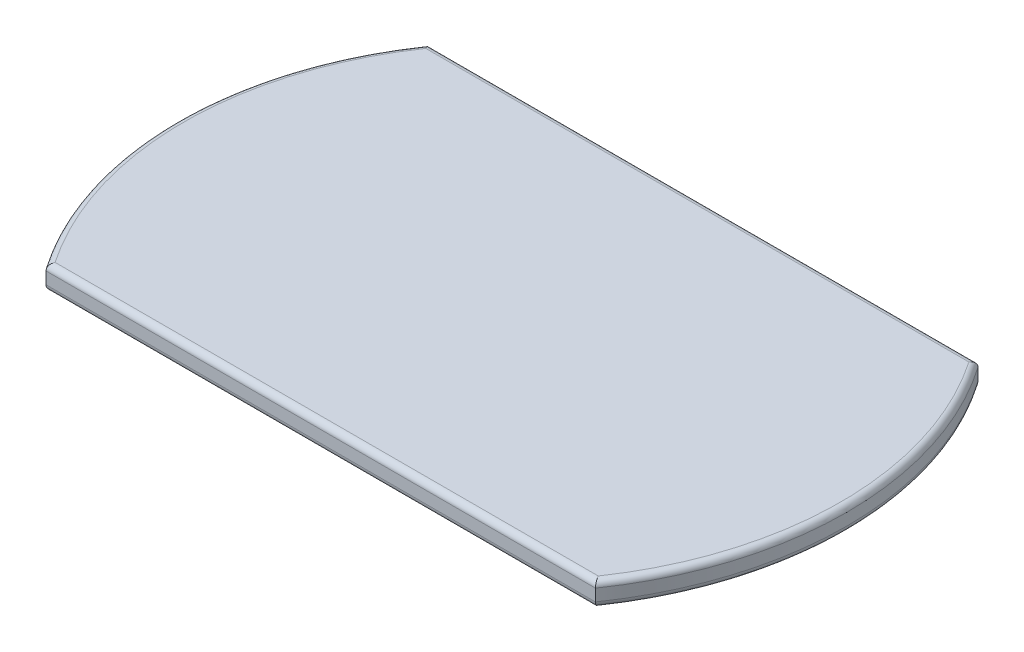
ISO-10303-21;
HEADER;
FILE_DESCRIPTION(('STEP AP214'),'2;1');
FILE_NAME('part.step','',(''),(''),'','','');
FILE_SCHEMA(('AUTOMOTIVE_DESIGN { 1 0 10303 214 1 1 1 1 }'));
ENDSEC;
DATA;
#1=APPLICATION_CONTEXT('core data for automotive mechanical design processes');
#2=APPLICATION_PROTOCOL_DEFINITION('international standard','automotive_design',2000,#1);
#3=PRODUCT_CONTEXT('',#1,'mechanical');
#4=PRODUCT('Part','Part','',(#3));
#5=PRODUCT_RELATED_PRODUCT_CATEGORY('part','',(#4));
#6=PRODUCT_DEFINITION_FORMATION('','',#4);
#7=PRODUCT_DEFINITION_CONTEXT('part definition',#1,'design');
#8=PRODUCT_DEFINITION('design','',#6,#7);
#9=PRODUCT_DEFINITION_SHAPE('','',#8);
#10=(LENGTH_UNIT() NAMED_UNIT(*) SI_UNIT(.MILLI.,.METRE.));
#11=(NAMED_UNIT(*) PLANE_ANGLE_UNIT() SI_UNIT($,.RADIAN.));
#12=(NAMED_UNIT(*) SI_UNIT($,.STERADIAN.) SOLID_ANGLE_UNIT());
#13=UNCERTAINTY_MEASURE_WITH_UNIT(LENGTH_MEASURE(1.E-05),#10,'distance_accuracy_value','');
#14=(GEOMETRIC_REPRESENTATION_CONTEXT(3) GLOBAL_UNCERTAINTY_ASSIGNED_CONTEXT((#13)) GLOBAL_UNIT_ASSIGNED_CONTEXT((#10,
#11,#12)) REPRESENTATION_CONTEXT('',''));
#15=CARTESIAN_POINT('',(0.,0.,0.));
#16=DIRECTION('',(0.,0.,1.));
#17=DIRECTION('',(1.,0.,0.));
#18=AXIS2_PLACEMENT_3D('',#15,#16,#17);
#19=CARTESIAN_POINT('',(0.,-12.7,0.));
#20=DIRECTION('',(0.,1.,0.));
#21=DIRECTION('',(0.,0.,1.));
#22=AXIS2_PLACEMENT_3D('',#19,#20,#21);
#23=CYLINDRICAL_SURFACE('',#22,177.8);
#24=DIRECTION('',(0.,1.,0.));
#25=VECTOR('',#24,1.);
#26=CARTESIAN_POINT('',(-145.911891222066,-12.7,-101.6));
#27=LINE('',#26,#25);
#28=CARTESIAN_POINT('',(-145.911891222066,-9.525,-101.6));
#29=VERTEX_POINT('',#28);
#30=CARTESIAN_POINT('',(-145.911891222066,-3.175,-101.6));
#31=VERTEX_POINT('',#30);
#32=EDGE_CURVE('E117',#29,#31,#27,.T.);
#33=ORIENTED_EDGE('',*,*,#32,.F.);
#34=CARTESIAN_POINT('',(0.,-9.525,0.));
#35=DIRECTION('',(0.,1.,0.));
#36=DIRECTION('',(0.,0.,1.));
#37=AXIS2_PLACEMENT_3D('',#34,#35,#36);
#38=CIRCLE('',#37,177.8);
#39=CARTESIAN_POINT('',(-145.911891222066,-9.525,101.6));
#40=VERTEX_POINT('',#39);
#41=EDGE_CURVE('E11',#29,#40,#38,.T.);
#42=ORIENTED_EDGE('',*,*,#41,.T.);
#43=DIRECTION('',(0.,1.,0.));
#44=VECTOR('',#43,1.);
#45=CARTESIAN_POINT('',(-145.911891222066,-12.7,101.6));
#46=LINE('',#45,#44);
#47=CARTESIAN_POINT('',(-145.911891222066,-3.175,101.6));
#48=VERTEX_POINT('',#47);
#49=EDGE_CURVE('E256',#40,#48,#46,.T.);
#50=ORIENTED_EDGE('',*,*,#49,.T.);
#51=CARTESIAN_POINT('',(0.,-3.175,0.));
#52=DIRECTION('',(0.,1.,0.));
#53=DIRECTION('',(0.,0.,1.));
#54=AXIS2_PLACEMENT_3D('',#51,#52,#53);
#55=CIRCLE('',#54,177.8);
#56=EDGE_CURVE('E134',#48,#31,#55,.F.);
#57=ORIENTED_EDGE('',*,*,#56,.T.);
#58=EDGE_LOOP('',(#33,#42,#50,#57));
#59=FACE_BOUND('',#58,.T.);
#60=ADVANCED_FACE('F32',(#59),#23,.T.);
#61=CARTESIAN_POINT('',(-145.911891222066,-12.7,-101.6));
#62=DIRECTION('',(0.,0.,-1.));
#63=DIRECTION('',(-1.,0.,0.));
#64=AXIS2_PLACEMENT_3D('',#61,#62,#63);
#65=PLANE('',#64);
#66=DIRECTION('',(0.,1.,0.));
#67=VECTOR('',#66,1.);
#68=CARTESIAN_POINT('',(145.911891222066,-12.7,-101.6));
#69=LINE('',#68,#67);
#70=CARTESIAN_POINT('',(145.911891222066,-9.525,-101.6));
#71=VERTEX_POINT('',#70);
#72=CARTESIAN_POINT('',(145.911891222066,-3.175,-101.6));
#73=VERTEX_POINT('',#72);
#74=EDGE_CURVE('E252',#71,#73,#69,.T.);
#75=ORIENTED_EDGE('',*,*,#74,.F.);
#76=DIRECTION('',(-1.,0.,0.));
#77=VECTOR('',#76,1.);
#78=CARTESIAN_POINT('',(-145.911891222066,-9.525,-101.6));
#79=LINE('',#78,#77);
#80=EDGE_CURVE('E39',#71,#29,#79,.T.);
#81=ORIENTED_EDGE('',*,*,#80,.T.);
#82=ORIENTED_EDGE('',*,*,#32,.T.);
#83=DIRECTION('',(-1.,0.,0.));
#84=VECTOR('',#83,1.);
#85=CARTESIAN_POINT('',(-145.911891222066,-3.175,-101.6));
#86=LINE('',#85,#84);
#87=EDGE_CURVE('E103',#31,#73,#86,.F.);
#88=ORIENTED_EDGE('',*,*,#87,.T.);
#89=EDGE_LOOP('',(#75,#81,#82,#88));
#90=FACE_BOUND('',#89,.T.);
#91=ADVANCED_FACE('F236',(#90),#65,.T.);
#92=CARTESIAN_POINT('',(0.,-12.7,0.));
#93=DIRECTION('',(0.,1.,0.));
#94=DIRECTION('',(0.,0.,1.));
#95=AXIS2_PLACEMENT_3D('',#92,#93,#94);
#96=CYLINDRICAL_SURFACE('',#95,177.8);
#97=DIRECTION('',(0.,1.,0.));
#98=VECTOR('',#97,1.);
#99=CARTESIAN_POINT('',(145.911891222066,-12.7,101.6));
#100=LINE('',#99,#98);
#101=CARTESIAN_POINT('',(145.911891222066,-9.525,101.6));
#102=VERTEX_POINT('',#101);
#103=CARTESIAN_POINT('',(145.911891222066,-3.175,101.6));
#104=VERTEX_POINT('',#103);
#105=EDGE_CURVE('E255',#102,#104,#100,.T.);
#106=ORIENTED_EDGE('',*,*,#105,.F.);
#107=CARTESIAN_POINT('',(0.,-9.525,0.));
#108=DIRECTION('',(0.,1.,0.));
#109=DIRECTION('',(0.,0.,1.));
#110=AXIS2_PLACEMENT_3D('',#107,#108,#109);
#111=CIRCLE('',#110,177.8);
#112=EDGE_CURVE('E53',#102,#71,#111,.T.);
#113=ORIENTED_EDGE('',*,*,#112,.T.);
#114=ORIENTED_EDGE('',*,*,#74,.T.);
#115=CARTESIAN_POINT('',(0.,-3.175,0.));
#116=DIRECTION('',(0.,1.,0.));
#117=DIRECTION('',(0.,0.,1.));
#118=AXIS2_PLACEMENT_3D('',#115,#116,#117);
#119=CIRCLE('',#118,177.8);
#120=EDGE_CURVE('E124',#73,#104,#119,.F.);
#121=ORIENTED_EDGE('',*,*,#120,.T.);
#122=EDGE_LOOP('',(#106,#113,#114,#121));
#123=FACE_BOUND('',#122,.T.);
#124=ADVANCED_FACE('F239',(#123),#96,.T.);
#125=CARTESIAN_POINT('',(-145.911891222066,-12.7,101.6));
#126=DIRECTION('',(0.,0.,1.));
#127=DIRECTION('',(1.,0.,0.));
#128=AXIS2_PLACEMENT_3D('',#125,#126,#127);
#129=PLANE('',#128);
#130=ORIENTED_EDGE('',*,*,#49,.F.);
#131=DIRECTION('',(1.,0.,0.));
#132=VECTOR('',#131,1.);
#133=CARTESIAN_POINT('',(145.911891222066,-9.525,101.6));
#134=LINE('',#133,#132);
#135=EDGE_CURVE('E137',#40,#102,#134,.T.);
#136=ORIENTED_EDGE('',*,*,#135,.T.);
#137=ORIENTED_EDGE('',*,*,#105,.T.);
#138=DIRECTION('',(1.,0.,0.));
#139=VECTOR('',#138,1.);
#140=CARTESIAN_POINT('',(-145.911891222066,-3.175,101.6));
#141=LINE('',#140,#139);
#142=EDGE_CURVE('E131',#104,#48,#141,.F.);
#143=ORIENTED_EDGE('',*,*,#142,.T.);
#144=EDGE_LOOP('',(#130,#136,#137,#143));
#145=FACE_BOUND('',#144,.T.);
#146=ADVANCED_FACE('F235',(#145),#129,.T.);
#147=CARTESIAN_POINT('',(0.,-12.7,0.));
#148=DIRECTION('',(0.,1.,0.));
#149=DIRECTION('',(0.,0.,1.));
#150=AXIS2_PLACEMENT_3D('',#147,#148,#149);
#151=PLANE('',#150);
#152=CARTESIAN_POINT('',(0.,-12.7,0.));
#153=DIRECTION('',(0.,1.,0.));
#154=DIRECTION('',(0.,0.,1.));
#155=AXIS2_PLACEMENT_3D('',#152,#153,#154);
#156=CIRCLE('',#155,174.625);
#157=CARTESIAN_POINT('',(144.244271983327,-12.7,-98.425));
#158=VERTEX_POINT('',#157);
#159=CARTESIAN_POINT('',(144.244271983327,-12.7,98.425));
#160=VERTEX_POINT('',#159);
#161=EDGE_CURVE('E144',#158,#160,#156,.F.);
#162=ORIENTED_EDGE('',*,*,#161,.T.);
#163=DIRECTION('',(1.,0.,0.));
#164=VECTOR('',#163,1.);
#165=CARTESIAN_POINT('',(-145.911891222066,-12.7,98.425));
#166=LINE('',#165,#164);
#167=CARTESIAN_POINT('',(-144.244271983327,-12.7,98.425));
#168=VERTEX_POINT('',#167);
#169=EDGE_CURVE('E146',#160,#168,#166,.F.);
#170=ORIENTED_EDGE('',*,*,#169,.T.);
#171=CARTESIAN_POINT('',(0.,-12.7,0.));
#172=DIRECTION('',(0.,1.,0.));
#173=DIRECTION('',(0.,0.,1.));
#174=AXIS2_PLACEMENT_3D('',#171,#172,#173);
#175=CIRCLE('',#174,174.625);
#176=CARTESIAN_POINT('',(-144.244271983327,-12.7,-98.425));
#177=VERTEX_POINT('',#176);
#178=EDGE_CURVE('E140',#168,#177,#175,.F.);
#179=ORIENTED_EDGE('',*,*,#178,.T.);
#180=DIRECTION('',(-1.,0.,0.));
#181=VECTOR('',#180,1.);
#182=CARTESIAN_POINT('',(145.911891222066,-12.7,-98.425));
#183=LINE('',#182,#181);
#184=EDGE_CURVE('E142',#177,#158,#183,.F.);
#185=ORIENTED_EDGE('',*,*,#184,.T.);
#186=EDGE_LOOP('',(#162,#170,#179,#185));
#187=FACE_BOUND('',#186,.T.);
#188=ADVANCED_FACE('F151',(#187),#151,.F.);
#189=CARTESIAN_POINT('',(0.,0.,0.));
#190=DIRECTION('',(0.,1.,0.));
#191=DIRECTION('',(0.,0.,1.));
#192=AXIS2_PLACEMENT_3D('',#189,#190,#191);
#193=PLANE('',#192);
#194=CARTESIAN_POINT('',(0.,0.,0.));
#195=DIRECTION('',(0.,1.,0.));
#196=DIRECTION('',(0.,0.,1.));
#197=AXIS2_PLACEMENT_3D('',#194,#195,#196);
#198=CIRCLE('',#197,174.625);
#199=CARTESIAN_POINT('',(144.244271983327,0.,98.425));
#200=VERTEX_POINT('',#199);
#201=CARTESIAN_POINT('',(144.244271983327,0.,-98.425));
#202=VERTEX_POINT('',#201);
#203=EDGE_CURVE('E121',#200,#202,#198,.T.);
#204=ORIENTED_EDGE('',*,*,#203,.T.);
#205=DIRECTION('',(-1.,0.,0.));
#206=VECTOR('',#205,1.);
#207=CARTESIAN_POINT('',(0.,0.,-98.425));
#208=LINE('',#207,#206);
#209=CARTESIAN_POINT('',(-144.244271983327,0.,-98.425));
#210=VERTEX_POINT('',#209);
#211=EDGE_CURVE('E101',#202,#210,#208,.T.);
#212=ORIENTED_EDGE('',*,*,#211,.T.);
#213=CARTESIAN_POINT('',(0.,0.,0.));
#214=DIRECTION('',(0.,1.,0.));
#215=DIRECTION('',(0.,0.,1.));
#216=AXIS2_PLACEMENT_3D('',#213,#214,#215);
#217=CIRCLE('',#216,174.625);
#218=CARTESIAN_POINT('',(-144.244271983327,0.,98.425));
#219=VERTEX_POINT('',#218);
#220=EDGE_CURVE('E110',#210,#219,#217,.T.);
#221=ORIENTED_EDGE('',*,*,#220,.T.);
#222=DIRECTION('',(1.,0.,0.));
#223=VECTOR('',#222,1.);
#224=CARTESIAN_POINT('',(0.,0.,98.425));
#225=LINE('',#224,#223);
#226=EDGE_CURVE('E116',#219,#200,#225,.T.);
#227=ORIENTED_EDGE('',*,*,#226,.T.);
#228=EDGE_LOOP('',(#204,#212,#221,#227));
#229=FACE_BOUND('',#228,.T.);
#230=ADVANCED_FACE('F119',(#229),#193,.T.);
#231=CARTESIAN_POINT('',(0.,-3.175,98.425));
#232=DIRECTION('',(1.,0.,0.));
#233=DIRECTION('',(0.,0.,-1.));
#234=AXIS2_PLACEMENT_3D('',#231,#232,#233);
#235=CYLINDRICAL_SURFACE('',#234,3.175);
#236=CARTESIAN_POINT('',(-145.911891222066,-3.175,101.6));
#237=CARTESIAN_POINT('',(-145.911897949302,-3.09298623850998,101.60001310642));
#238=CARTESIAN_POINT('',(-145.91023185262,-3.01097973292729,101.596822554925));
#239=CARTESIAN_POINT('',(-145.903605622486,-2.847612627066,101.584134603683));
#240=CARTESIAN_POINT('',(-145.898646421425,-2.76625185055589,101.574638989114));
#241=CARTESIAN_POINT('',(-145.88550979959,-2.60505816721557,101.549487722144));
#242=CARTESIAN_POINT('',(-145.877344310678,-2.52522073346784,101.533854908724));
#243=CARTESIAN_POINT('',(-145.857899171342,-2.36735467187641,101.496631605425));
#244=CARTESIAN_POINT('',(-145.846619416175,-2.28932610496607,101.475040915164));
#245=CARTESIAN_POINT('',(-145.808300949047,-2.05886594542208,101.40170581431));
#246=CARTESIAN_POINT('',(-145.7767618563,-1.90980503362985,101.341357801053));
#247=CARTESIAN_POINT('',(-145.703003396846,-1.62458287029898,101.200287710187));
#248=CARTESIAN_POINT('',(-145.660776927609,-1.48843028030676,101.119552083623));
#249=CARTESIAN_POINT('',(-145.565071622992,-1.22593300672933,100.936664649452));
#250=CARTESIAN_POINT('',(-145.511175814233,-1.10029398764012,100.833719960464));
#251=CARTESIAN_POINT('',(-145.395171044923,-0.868013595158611,100.612286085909));
#252=CARTESIAN_POINT('',(-145.333059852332,-0.761377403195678,100.493792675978));
#253=CARTESIAN_POINT('',(-145.195287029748,-0.557950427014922,100.231142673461));
#254=CARTESIAN_POINT('',(-145.118886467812,-0.463456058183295,100.085596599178));
#255=CARTESIAN_POINT('',(-144.960212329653,-0.300212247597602,99.7835751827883));
#256=CARTESIAN_POINT('',(-144.877933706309,-0.23148525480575,99.6270904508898));
#257=CARTESIAN_POINT('',(-144.705862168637,-0.117869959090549,99.3001235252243));
#258=CARTESIAN_POINT('',(-144.615898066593,-0.0741493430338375,99.1293285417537));
#259=CARTESIAN_POINT('',(-144.433958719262,-0.0155555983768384,98.784253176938));
#260=CARTESIAN_POINT('',(-144.341988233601,-0.000620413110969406,98.6099811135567));
#261=CARTESIAN_POINT('',(-144.248133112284,-6.29755687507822E-06,98.4323090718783));
#262=CARTESIAN_POINT('',(-144.246202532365,1.2426472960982E-08,98.4286544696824));
#263=CARTESIAN_POINT('',(-144.244271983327,0.,98.425));
#264=B_SPLINE_CURVE_WITH_KNOTS('',3,(#236,#237,#238,#239,#240,#241,#242,#243,#244,#245,#246,
#247,#248,#249,#250,#251,#252,#253,#254,#255,#256,#257,#258,#259,#260,#261,#262,#263),
.UNSPECIFIED.,.F.,.F.,(4,2,2,2,2,2,2,2,2,2,2,2,2,4),(0.,0.245950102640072,0.491830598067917,
0.73680461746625,0.981786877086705,1.47098445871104,1.9605080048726,2.47180633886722,
2.98324387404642,3.54975015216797,4.11674883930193,4.70842442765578,5.2988230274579,
5.31122258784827),.UNSPECIFIED.);
#265=EDGE_CURVE('E113',#48,#219,#264,.T.);
#266=ORIENTED_EDGE('',*,*,#265,.F.);
#267=ORIENTED_EDGE('',*,*,#142,.F.);
#268=CARTESIAN_POINT('',(145.911891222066,-3.175,101.6));
#269=CARTESIAN_POINT('',(145.911897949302,-3.09298623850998,101.60001310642));
#270=CARTESIAN_POINT('',(145.91023185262,-3.01097973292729,101.596822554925));
#271=CARTESIAN_POINT('',(145.903605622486,-2.847612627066,101.584134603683));
#272=CARTESIAN_POINT('',(145.898646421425,-2.76625185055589,101.574638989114));
#273=CARTESIAN_POINT('',(145.88550979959,-2.60505816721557,101.549487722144));
#274=CARTESIAN_POINT('',(145.877344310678,-2.52522073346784,101.533854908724));
#275=CARTESIAN_POINT('',(145.857899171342,-2.36735467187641,101.496631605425));
#276=CARTESIAN_POINT('',(145.846619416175,-2.28932610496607,101.475040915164));
#277=CARTESIAN_POINT('',(145.808300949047,-2.05886594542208,101.40170581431));
#278=CARTESIAN_POINT('',(145.7767618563,-1.90980503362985,101.341357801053));
#279=CARTESIAN_POINT('',(145.703003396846,-1.62458287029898,101.200287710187));
#280=CARTESIAN_POINT('',(145.660776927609,-1.48843028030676,101.119552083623));
#281=CARTESIAN_POINT('',(145.565071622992,-1.22593300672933,100.936664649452));
#282=CARTESIAN_POINT('',(145.511175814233,-1.10029398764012,100.833719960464));
#283=CARTESIAN_POINT('',(145.395171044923,-0.868013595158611,100.612286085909));
#284=CARTESIAN_POINT('',(145.333059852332,-0.761377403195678,100.493792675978));
#285=CARTESIAN_POINT('',(145.195287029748,-0.557950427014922,100.231142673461));
#286=CARTESIAN_POINT('',(145.118886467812,-0.463456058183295,100.085596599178));
#287=CARTESIAN_POINT('',(144.960212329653,-0.300212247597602,99.7835751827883));
#288=CARTESIAN_POINT('',(144.877933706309,-0.23148525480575,99.6270904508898));
#289=CARTESIAN_POINT('',(144.705862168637,-0.117869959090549,99.3001235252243));
#290=CARTESIAN_POINT('',(144.615898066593,-0.0741493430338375,99.1293285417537));
#291=CARTESIAN_POINT('',(144.433958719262,-0.0155555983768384,98.784253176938));
#292=CARTESIAN_POINT('',(144.341988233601,-0.000620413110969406,98.6099811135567));
#293=CARTESIAN_POINT('',(144.248133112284,-6.29755687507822E-06,98.4323090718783));
#294=CARTESIAN_POINT('',(144.246202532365,1.2426472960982E-08,98.4286544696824));
#295=CARTESIAN_POINT('',(144.244271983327,0.,98.425));
#296=B_SPLINE_CURVE_WITH_KNOTS('',3,(#268,#269,#270,#271,#272,#273,#274,#275,#276,#277,#278,
#279,#280,#281,#282,#283,#284,#285,#286,#287,#288,#289,#290,#291,#292,#293,#294,#295),
.UNSPECIFIED.,.F.,.F.,(4,2,2,2,2,2,2,2,2,2,2,2,2,4),(0.,0.245950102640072,0.491830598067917,
0.73680461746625,0.981786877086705,1.47098445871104,1.9605080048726,2.47180633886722,
2.98324387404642,3.54975015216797,4.11674883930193,4.70842442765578,5.2988230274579,
5.31122258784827),.UNSPECIFIED.);
#297=EDGE_CURVE('E220',#200,#104,#296,.F.);
#298=ORIENTED_EDGE('',*,*,#297,.F.);
#299=ORIENTED_EDGE('',*,*,#226,.F.);
#300=EDGE_LOOP('',(#266,#267,#298,#299));
#301=FACE_BOUND('',#300,.T.);
#302=ADVANCED_FACE('F225',(#301),#235,.T.);
#303=CARTESIAN_POINT('',(0.,-3.175,0.));
#304=DIRECTION('',(0.,1.,0.));
#305=DIRECTION('',(0.,0.,1.));
#306=AXIS2_PLACEMENT_3D('',#303,#304,#305);
#307=TOROIDAL_SURFACE('',#306,174.625,3.175);
#308=ORIENTED_EDGE('',*,*,#297,.T.);
#309=ORIENTED_EDGE('',*,*,#120,.F.);
#310=CARTESIAN_POINT('',(145.911891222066,-3.175,-101.6));
#311=CARTESIAN_POINT('',(145.911897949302,-3.09298623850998,-101.60001310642));
#312=CARTESIAN_POINT('',(145.91023185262,-3.01097973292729,-101.596822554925));
#313=CARTESIAN_POINT('',(145.903605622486,-2.847612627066,-101.584134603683));
#314=CARTESIAN_POINT('',(145.898646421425,-2.76625185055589,-101.574638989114));
#315=CARTESIAN_POINT('',(145.88550979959,-2.60505816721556,-101.549487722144));
#316=CARTESIAN_POINT('',(145.877344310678,-2.52522073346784,-101.533854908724));
#317=CARTESIAN_POINT('',(145.857899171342,-2.36735467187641,-101.496631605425));
#318=CARTESIAN_POINT('',(145.846619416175,-2.28932610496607,-101.475040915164));
#319=CARTESIAN_POINT('',(145.808300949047,-2.05886594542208,-101.40170581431));
#320=CARTESIAN_POINT('',(145.7767618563,-1.90980503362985,-101.341357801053));
#321=CARTESIAN_POINT('',(145.703003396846,-1.62458287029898,-101.200287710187));
#322=CARTESIAN_POINT('',(145.660776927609,-1.48843028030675,-101.119552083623));
#323=CARTESIAN_POINT('',(145.565071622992,-1.22593300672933,-100.936664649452));
#324=CARTESIAN_POINT('',(145.511175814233,-1.10029398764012,-100.833719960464));
#325=CARTESIAN_POINT('',(145.395171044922,-0.868013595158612,-100.612286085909));
#326=CARTESIAN_POINT('',(145.333059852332,-0.761377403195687,-100.493792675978));
#327=CARTESIAN_POINT('',(145.195287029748,-0.557950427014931,-100.231142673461));
#328=CARTESIAN_POINT('',(145.118886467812,-0.463456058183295,-100.085596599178));
#329=CARTESIAN_POINT('',(144.960212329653,-0.300212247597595,-99.7835751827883));
#330=CARTESIAN_POINT('',(144.877933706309,-0.231485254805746,-99.6270904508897));
#331=CARTESIAN_POINT('',(144.705862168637,-0.117869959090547,-99.3001235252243));
#332=CARTESIAN_POINT('',(144.615898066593,-0.0741493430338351,-99.1293285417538));
#333=CARTESIAN_POINT('',(144.433958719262,-0.015555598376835,-98.7842531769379));
#334=CARTESIAN_POINT('',(144.341988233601,-0.000620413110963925,-98.6099811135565));
#335=CARTESIAN_POINT('',(144.248133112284,-6.29755687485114E-06,-98.4323090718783));
#336=CARTESIAN_POINT('',(144.246202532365,1.24264730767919E-08,-98.4286544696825));
#337=CARTESIAN_POINT('',(144.244271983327,0.,-98.425));
#338=B_SPLINE_CURVE_WITH_KNOTS('',3,(#310,#311,#312,#313,#314,#315,#316,#317,#318,#319,#320,
#321,#322,#323,#324,#325,#326,#327,#328,#329,#330,#331,#332,#333,#334,#335,#336,#337),
.UNSPECIFIED.,.F.,.F.,(4,2,2,2,2,2,2,2,2,2,2,2,2,4),(0.,0.245950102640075,0.491830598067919,
0.736804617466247,0.981786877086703,1.47098445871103,1.96050800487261,2.47180633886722,
2.98324387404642,3.54975015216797,4.11674883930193,4.7084244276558,5.29882302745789,
5.31122258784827),.UNSPECIFIED.);
#339=EDGE_CURVE('E106',#202,#73,#338,.F.);
#340=ORIENTED_EDGE('',*,*,#339,.F.);
#341=ORIENTED_EDGE('',*,*,#203,.F.);
#342=EDGE_LOOP('',(#308,#309,#340,#341));
#343=FACE_BOUND('',#342,.T.);
#344=ADVANCED_FACE('F212',(#343),#307,.T.);
#345=CARTESIAN_POINT('',(0.,-3.175,0.));
#346=DIRECTION('',(0.,1.,0.));
#347=DIRECTION('',(0.,0.,1.));
#348=AXIS2_PLACEMENT_3D('',#345,#346,#347);
#349=TOROIDAL_SURFACE('',#348,174.625,3.175);
#350=ORIENTED_EDGE('',*,*,#265,.T.);
#351=ORIENTED_EDGE('',*,*,#220,.F.);
#352=CARTESIAN_POINT('',(-145.911891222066,-3.175,-101.6));
#353=CARTESIAN_POINT('',(-145.911897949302,-3.09298623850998,-101.60001310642));
#354=CARTESIAN_POINT('',(-145.91023185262,-3.01097973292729,-101.596822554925));
#355=CARTESIAN_POINT('',(-145.903605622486,-2.847612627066,-101.584134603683));
#356=CARTESIAN_POINT('',(-145.898646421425,-2.76625185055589,-101.574638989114));
#357=CARTESIAN_POINT('',(-145.88550979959,-2.60505816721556,-101.549487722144));
#358=CARTESIAN_POINT('',(-145.877344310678,-2.52522073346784,-101.533854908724));
#359=CARTESIAN_POINT('',(-145.857899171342,-2.36735467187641,-101.496631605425));
#360=CARTESIAN_POINT('',(-145.846619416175,-2.28932610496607,-101.475040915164));
#361=CARTESIAN_POINT('',(-145.808300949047,-2.05886594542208,-101.40170581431));
#362=CARTESIAN_POINT('',(-145.7767618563,-1.90980503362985,-101.341357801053));
#363=CARTESIAN_POINT('',(-145.703003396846,-1.62458287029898,-101.200287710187));
#364=CARTESIAN_POINT('',(-145.660776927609,-1.48843028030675,-101.119552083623));
#365=CARTESIAN_POINT('',(-145.565071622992,-1.22593300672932,-100.936664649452));
#366=CARTESIAN_POINT('',(-145.511175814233,-1.1002939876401,-100.833719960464));
#367=CARTESIAN_POINT('',(-145.395171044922,-0.868013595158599,-100.612286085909));
#368=CARTESIAN_POINT('',(-145.333059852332,-0.761377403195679,-100.493792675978));
#369=CARTESIAN_POINT('',(-145.195287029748,-0.557950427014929,-100.231142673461));
#370=CARTESIAN_POINT('',(-145.118886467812,-0.463456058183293,-100.085596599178));
#371=CARTESIAN_POINT('',(-144.960212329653,-0.300212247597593,-99.7835751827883));
#372=CARTESIAN_POINT('',(-144.877933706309,-0.231485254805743,-99.6270904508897));
#373=CARTESIAN_POINT('',(-144.705862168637,-0.117869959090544,-99.3001235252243));
#374=CARTESIAN_POINT('',(-144.615898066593,-0.0741493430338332,-99.1293285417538));
#375=CARTESIAN_POINT('',(-144.433958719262,-0.015555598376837,-98.7842531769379));
#376=CARTESIAN_POINT('',(-144.341988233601,-0.000620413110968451,-98.6099811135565));
#377=CARTESIAN_POINT('',(-144.248133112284,-6.29755687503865E-06,-98.4323090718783));
#378=CARTESIAN_POINT('',(-144.246202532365,1.24264729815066E-08,-98.4286544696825));
#379=CARTESIAN_POINT('',(-144.244271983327,0.,-98.425));
#380=B_SPLINE_CURVE_WITH_KNOTS('',3,(#352,#353,#354,#355,#356,#357,#358,#359,#360,#361,#362,
#363,#364,#365,#366,#367,#368,#369,#370,#371,#372,#373,#374,#375,#376,#377,#378,#379),
.UNSPECIFIED.,.F.,.F.,(4,2,2,2,2,2,2,2,2,2,2,2,2,4),(0.,0.245950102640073,0.491830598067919,
0.736804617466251,0.981786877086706,1.47098445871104,1.96050800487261,2.47180633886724,
2.98324387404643,3.54975015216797,4.11674883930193,4.7084244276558,5.29882302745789,
5.31122258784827),.UNSPECIFIED.);
#381=EDGE_CURVE('E96',#31,#210,#380,.T.);
#382=ORIENTED_EDGE('',*,*,#381,.F.);
#383=ORIENTED_EDGE('',*,*,#56,.F.);
#384=EDGE_LOOP('',(#350,#351,#382,#383));
#385=FACE_BOUND('',#384,.T.);
#386=ADVANCED_FACE('F111',(#385),#349,.T.);
#387=CARTESIAN_POINT('',(0.,-3.175,-98.425));
#388=DIRECTION('',(-1.,0.,0.));
#389=DIRECTION('',(0.,0.,1.));
#390=AXIS2_PLACEMENT_3D('',#387,#388,#389);
#391=CYLINDRICAL_SURFACE('',#390,3.175);
#392=ORIENTED_EDGE('',*,*,#339,.T.);
#393=ORIENTED_EDGE('',*,*,#87,.F.);
#394=ORIENTED_EDGE('',*,*,#381,.T.);
#395=ORIENTED_EDGE('',*,*,#211,.F.);
#396=EDGE_LOOP('',(#392,#393,#394,#395));
#397=FACE_BOUND('',#396,.T.);
#398=ADVANCED_FACE('F99',(#397),#391,.T.);
#399=CARTESIAN_POINT('',(-145.911891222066,-9.525,-98.425));
#400=DIRECTION('',(1.,0.,0.));
#401=DIRECTION('',(0.,0.,-1.));
#402=AXIS2_PLACEMENT_3D('',#399,#400,#401);
#403=CYLINDRICAL_SURFACE('',#402,3.175);
#404=CARTESIAN_POINT('',(145.911891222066,-9.525,-101.6));
#405=CARTESIAN_POINT('',(145.911897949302,-9.60701376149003,-101.60001310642));
#406=CARTESIAN_POINT('',(145.91023185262,-9.68902026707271,-101.596822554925));
#407=CARTESIAN_POINT('',(145.903605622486,-9.85238737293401,-101.584134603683));
#408=CARTESIAN_POINT('',(145.898646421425,-9.93374814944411,-101.574638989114));
#409=CARTESIAN_POINT('',(145.88550979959,-10.0949418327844,-101.549487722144));
#410=CARTESIAN_POINT('',(145.877344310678,-10.1747792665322,-101.533854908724));
#411=CARTESIAN_POINT('',(145.857899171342,-10.3326453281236,-101.496631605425));
#412=CARTESIAN_POINT('',(145.846619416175,-10.4106738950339,-101.475040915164));
#413=CARTESIAN_POINT('',(145.808300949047,-10.6411340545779,-101.40170581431));
#414=CARTESIAN_POINT('',(145.7767618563,-10.7901949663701,-101.341357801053));
#415=CARTESIAN_POINT('',(145.703003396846,-11.075417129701,-101.200287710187));
#416=CARTESIAN_POINT('',(145.660776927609,-11.2115697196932,-101.119552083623));
#417=CARTESIAN_POINT('',(145.565071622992,-11.4740669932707,-100.936664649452));
#418=CARTESIAN_POINT('',(145.511175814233,-11.5997060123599,-100.833719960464));
#419=CARTESIAN_POINT('',(145.395171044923,-11.8319864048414,-100.612286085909));
#420=CARTESIAN_POINT('',(145.333059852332,-11.9386225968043,-100.493792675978));
#421=CARTESIAN_POINT('',(145.195287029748,-12.1420495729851,-100.231142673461));
#422=CARTESIAN_POINT('',(145.118886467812,-12.2365439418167,-100.085596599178));
#423=CARTESIAN_POINT('',(144.960212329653,-12.3997877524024,-99.7835751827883));
#424=CARTESIAN_POINT('',(144.87793370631,-12.4685147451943,-99.6270904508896));
#425=CARTESIAN_POINT('',(144.705862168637,-12.5821300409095,-99.3001235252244));
#426=CARTESIAN_POINT('',(144.615898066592,-12.6258506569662,-99.1293285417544));
#427=CARTESIAN_POINT('',(144.433958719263,-12.6844444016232,-98.7842531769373));
#428=CARTESIAN_POINT('',(144.341988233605,-12.699379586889,-98.6099811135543));
#429=CARTESIAN_POINT('',(144.248133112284,-12.6999937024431,-98.4323090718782));
#430=CARTESIAN_POINT('',(144.246202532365,-12.7000000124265,-98.4286544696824));
#431=CARTESIAN_POINT('',(144.244271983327,-12.7,-98.425));
#432=B_SPLINE_CURVE_WITH_KNOTS('',3,(#404,#405,#406,#407,#408,#409,#410,#411,#412,#413,#414,
#415,#416,#417,#418,#419,#420,#421,#422,#423,#424,#425,#426,#427,#428,#429,#430,#431),
.UNSPECIFIED.,.F.,.F.,(4,2,2,2,2,2,2,2,2,2,2,2,2,4),(0.,0.24595010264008,0.491830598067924,
0.736804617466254,0.981786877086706,1.47098445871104,1.96050800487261,2.47180633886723,
2.98324387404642,3.54975015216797,4.11674883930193,4.70842442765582,5.29882302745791,
5.31122258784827),.UNSPECIFIED.);
#433=EDGE_CURVE('E166',#158,#71,#432,.F.);
#434=ORIENTED_EDGE('',*,*,#433,.F.);
#435=ORIENTED_EDGE('',*,*,#184,.F.);
#436=CARTESIAN_POINT('',(-145.911891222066,-9.525,-101.6));
#437=CARTESIAN_POINT('',(-145.911897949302,-9.60701376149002,-101.60001310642));
#438=CARTESIAN_POINT('',(-145.91023185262,-9.68902026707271,-101.596822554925));
#439=CARTESIAN_POINT('',(-145.903605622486,-9.852387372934,-101.584134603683));
#440=CARTESIAN_POINT('',(-145.898646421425,-9.93374814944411,-101.574638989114));
#441=CARTESIAN_POINT('',(-145.88550979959,-10.0949418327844,-101.549487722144));
#442=CARTESIAN_POINT('',(-145.877344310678,-10.1747792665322,-101.533854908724));
#443=CARTESIAN_POINT('',(-145.857899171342,-10.3326453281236,-101.496631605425));
#444=CARTESIAN_POINT('',(-145.846619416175,-10.4106738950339,-101.475040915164));
#445=CARTESIAN_POINT('',(-145.808300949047,-10.6411340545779,-101.40170581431));
#446=CARTESIAN_POINT('',(-145.7767618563,-10.7901949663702,-101.341357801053));
#447=CARTESIAN_POINT('',(-145.703003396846,-11.075417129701,-101.200287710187));
#448=CARTESIAN_POINT('',(-145.660776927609,-11.2115697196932,-101.119552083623));
#449=CARTESIAN_POINT('',(-145.565071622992,-11.4740669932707,-100.936664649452));
#450=CARTESIAN_POINT('',(-145.511175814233,-11.5997060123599,-100.833719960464));
#451=CARTESIAN_POINT('',(-145.395171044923,-11.8319864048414,-100.612286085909));
#452=CARTESIAN_POINT('',(-145.333059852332,-11.9386225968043,-100.493792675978));
#453=CARTESIAN_POINT('',(-145.195287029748,-12.1420495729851,-100.231142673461));
#454=CARTESIAN_POINT('',(-145.118886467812,-12.2365439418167,-100.085596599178));
#455=CARTESIAN_POINT('',(-144.960212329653,-12.3997877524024,-99.7835751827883));
#456=CARTESIAN_POINT('',(-144.87793370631,-12.4685147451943,-99.6270904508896));
#457=CARTESIAN_POINT('',(-144.705862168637,-12.5821300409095,-99.3001235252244));
#458=CARTESIAN_POINT('',(-144.615898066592,-12.6258506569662,-99.1293285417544));
#459=CARTESIAN_POINT('',(-144.433958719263,-12.6844444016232,-98.7842531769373));
#460=CARTESIAN_POINT('',(-144.341988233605,-12.699379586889,-98.6099811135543));
#461=CARTESIAN_POINT('',(-144.248133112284,-12.6999937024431,-98.4323090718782));
#462=CARTESIAN_POINT('',(-144.246202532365,-12.7000000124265,-98.4286544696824));
#463=CARTESIAN_POINT('',(-144.244271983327,-12.7,-98.425));
#464=B_SPLINE_CURVE_WITH_KNOTS('',3,(#436,#437,#438,#439,#440,#441,#442,#443,#444,#445,#446,
#447,#448,#449,#450,#451,#452,#453,#454,#455,#456,#457,#458,#459,#460,#461,#462,#463),
.UNSPECIFIED.,.F.,.F.,(4,2,2,2,2,2,2,2,2,2,2,2,2,4),(0.,0.245950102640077,0.491830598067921,
0.73680461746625,0.981786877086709,1.47098445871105,1.96050800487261,2.47180633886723,
2.98324387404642,3.54975015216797,4.11674883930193,4.70842442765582,5.29882302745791,
5.31122258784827),.UNSPECIFIED.);
#465=EDGE_CURVE('E107',#29,#177,#464,.T.);
#466=ORIENTED_EDGE('',*,*,#465,.F.);
#467=ORIENTED_EDGE('',*,*,#80,.F.);
#468=EDGE_LOOP('',(#434,#435,#466,#467));
#469=FACE_BOUND('',#468,.T.);
#470=ADVANCED_FACE('F186',(#469),#403,.T.);
#471=CARTESIAN_POINT('',(0.,-9.525,0.));
#472=DIRECTION('',(0.,1.,0.));
#473=DIRECTION('',(0.,0.,1.));
#474=AXIS2_PLACEMENT_3D('',#471,#472,#473);
#475=TOROIDAL_SURFACE('',#474,174.625,3.175);
#476=ORIENTED_EDGE('',*,*,#465,.T.);
#477=ORIENTED_EDGE('',*,*,#178,.F.);
#478=CARTESIAN_POINT('',(-145.911891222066,-9.525,101.6));
#479=CARTESIAN_POINT('',(-145.911897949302,-9.60701376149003,101.60001310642));
#480=CARTESIAN_POINT('',(-145.91023185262,-9.68902026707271,101.596822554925));
#481=CARTESIAN_POINT('',(-145.903605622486,-9.852387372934,101.584134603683));
#482=CARTESIAN_POINT('',(-145.898646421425,-9.93374814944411,101.574638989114));
#483=CARTESIAN_POINT('',(-145.88550979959,-10.0949418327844,101.549487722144));
#484=CARTESIAN_POINT('',(-145.877344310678,-10.1747792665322,101.533854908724));
#485=CARTESIAN_POINT('',(-145.857899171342,-10.3326453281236,101.496631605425));
#486=CARTESIAN_POINT('',(-145.846619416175,-10.4106738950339,101.475040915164));
#487=CARTESIAN_POINT('',(-145.808300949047,-10.6411340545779,101.40170581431));
#488=CARTESIAN_POINT('',(-145.7767618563,-10.7901949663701,101.341357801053));
#489=CARTESIAN_POINT('',(-145.703003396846,-11.075417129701,101.200287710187));
#490=CARTESIAN_POINT('',(-145.660776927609,-11.2115697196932,101.119552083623));
#491=CARTESIAN_POINT('',(-145.565071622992,-11.4740669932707,100.936664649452));
#492=CARTESIAN_POINT('',(-145.511175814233,-11.5997060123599,100.833719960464));
#493=CARTESIAN_POINT('',(-145.395171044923,-11.8319864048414,100.612286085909));
#494=CARTESIAN_POINT('',(-145.333059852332,-11.9386225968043,100.493792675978));
#495=CARTESIAN_POINT('',(-145.195287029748,-12.1420495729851,100.231142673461));
#496=CARTESIAN_POINT('',(-145.118886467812,-12.2365439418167,100.085596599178));
#497=CARTESIAN_POINT('',(-144.960212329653,-12.3997877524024,99.7835751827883));
#498=CARTESIAN_POINT('',(-144.87793370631,-12.4685147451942,99.6270904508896));
#499=CARTESIAN_POINT('',(-144.705862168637,-12.5821300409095,99.3001235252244));
#500=CARTESIAN_POINT('',(-144.615898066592,-12.6258506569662,99.1293285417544));
#501=CARTESIAN_POINT('',(-144.433958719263,-12.6844444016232,98.7842531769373));
#502=CARTESIAN_POINT('',(-144.341988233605,-12.699379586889,98.6099811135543));
#503=CARTESIAN_POINT('',(-144.248133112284,-12.6999937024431,98.4323090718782));
#504=CARTESIAN_POINT('',(-144.246202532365,-12.7000000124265,98.4286544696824));
#505=CARTESIAN_POINT('',(-144.244271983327,-12.7,98.425));
#506=B_SPLINE_CURVE_WITH_KNOTS('',3,(#478,#479,#480,#481,#482,#483,#484,#485,#486,#487,#488,
#489,#490,#491,#492,#493,#494,#495,#496,#497,#498,#499,#500,#501,#502,#503,#504,#505),
.UNSPECIFIED.,.F.,.F.,(4,2,2,2,2,2,2,2,2,2,2,2,2,4),(0.,0.245950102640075,0.491830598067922,
0.73680461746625,0.981786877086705,1.47098445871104,1.96050800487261,2.47180633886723,
2.98324387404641,3.54975015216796,4.1167488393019,4.7084244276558,5.29882302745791,
5.31122258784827),.UNSPECIFIED.);
#507=EDGE_CURVE('E161',#40,#168,#506,.T.);
#508=ORIENTED_EDGE('',*,*,#507,.F.);
#509=ORIENTED_EDGE('',*,*,#41,.F.);
#510=EDGE_LOOP('',(#476,#477,#508,#509));
#511=FACE_BOUND('',#510,.T.);
#512=ADVANCED_FACE('F181',(#511),#475,.T.);
#513=CARTESIAN_POINT('',(0.,-9.525,0.));
#514=DIRECTION('',(0.,1.,0.));
#515=DIRECTION('',(0.,0.,1.));
#516=AXIS2_PLACEMENT_3D('',#513,#514,#515);
#517=TOROIDAL_SURFACE('',#516,174.625,3.175);
#518=ORIENTED_EDGE('',*,*,#433,.T.);
#519=ORIENTED_EDGE('',*,*,#112,.F.);
#520=CARTESIAN_POINT('',(145.911891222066,-9.525,101.6));
#521=CARTESIAN_POINT('',(145.911897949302,-9.60701376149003,101.60001310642));
#522=CARTESIAN_POINT('',(145.91023185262,-9.68902026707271,101.596822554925));
#523=CARTESIAN_POINT('',(145.903605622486,-9.852387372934,101.584134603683));
#524=CARTESIAN_POINT('',(145.898646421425,-9.93374814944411,101.574638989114));
#525=CARTESIAN_POINT('',(145.88550979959,-10.0949418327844,101.549487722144));
#526=CARTESIAN_POINT('',(145.877344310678,-10.1747792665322,101.533854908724));
#527=CARTESIAN_POINT('',(145.857899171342,-10.3326453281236,101.496631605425));
#528=CARTESIAN_POINT('',(145.846619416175,-10.4106738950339,101.475040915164));
#529=CARTESIAN_POINT('',(145.808300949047,-10.6411340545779,101.40170581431));
#530=CARTESIAN_POINT('',(145.7767618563,-10.7901949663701,101.341357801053));
#531=CARTESIAN_POINT('',(145.703003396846,-11.075417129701,101.200287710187));
#532=CARTESIAN_POINT('',(145.660776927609,-11.2115697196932,101.119552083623));
#533=CARTESIAN_POINT('',(145.565071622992,-11.4740669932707,100.936664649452));
#534=CARTESIAN_POINT('',(145.511175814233,-11.5997060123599,100.833719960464));
#535=CARTESIAN_POINT('',(145.395171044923,-11.8319864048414,100.612286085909));
#536=CARTESIAN_POINT('',(145.333059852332,-11.9386225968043,100.493792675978));
#537=CARTESIAN_POINT('',(145.195287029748,-12.1420495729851,100.231142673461));
#538=CARTESIAN_POINT('',(145.118886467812,-12.2365439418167,100.085596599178));
#539=CARTESIAN_POINT('',(144.960212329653,-12.3997877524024,99.7835751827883));
#540=CARTESIAN_POINT('',(144.87793370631,-12.4685147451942,99.6270904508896));
#541=CARTESIAN_POINT('',(144.705862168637,-12.5821300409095,99.3001235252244));
#542=CARTESIAN_POINT('',(144.615898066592,-12.6258506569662,99.1293285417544));
#543=CARTESIAN_POINT('',(144.433958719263,-12.6844444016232,98.7842531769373));
#544=CARTESIAN_POINT('',(144.341988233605,-12.699379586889,98.6099811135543));
#545=CARTESIAN_POINT('',(144.248133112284,-12.6999937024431,98.4323090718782));
#546=CARTESIAN_POINT('',(144.246202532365,-12.7000000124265,98.4286544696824));
#547=CARTESIAN_POINT('',(144.244271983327,-12.7,98.425));
#548=B_SPLINE_CURVE_WITH_KNOTS('',3,(#520,#521,#522,#523,#524,#525,#526,#527,#528,#529,#530,
#531,#532,#533,#534,#535,#536,#537,#538,#539,#540,#541,#542,#543,#544,#545,#546,#547),
.UNSPECIFIED.,.F.,.F.,(4,2,2,2,2,2,2,2,2,2,2,2,2,4),(0.,0.245950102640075,0.491830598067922,
0.73680461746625,0.981786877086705,1.47098445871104,1.96050800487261,2.47180633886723,
2.98324387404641,3.54975015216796,4.1167488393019,4.7084244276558,5.29882302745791,
5.31122258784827),.UNSPECIFIED.);
#549=EDGE_CURVE('E159',#160,#102,#548,.F.);
#550=ORIENTED_EDGE('',*,*,#549,.F.);
#551=ORIENTED_EDGE('',*,*,#161,.F.);
#552=EDGE_LOOP('',(#518,#519,#550,#551));
#553=FACE_BOUND('',#552,.T.);
#554=ADVANCED_FACE('F164',(#553),#517,.T.);
#555=CARTESIAN_POINT('',(-145.911891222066,-9.525,98.425));
#556=DIRECTION('',(-1.,0.,0.));
#557=DIRECTION('',(0.,0.,1.));
#558=AXIS2_PLACEMENT_3D('',#555,#556,#557);
#559=CYLINDRICAL_SURFACE('',#558,3.175);
#560=ORIENTED_EDGE('',*,*,#507,.T.);
#561=ORIENTED_EDGE('',*,*,#169,.F.);
#562=ORIENTED_EDGE('',*,*,#549,.T.);
#563=ORIENTED_EDGE('',*,*,#135,.F.);
#564=EDGE_LOOP('',(#560,#561,#562,#563));
#565=FACE_BOUND('',#564,.T.);
#566=ADVANCED_FACE('F157',(#565),#559,.T.);
#567=CLOSED_SHELL('',(#60,#91,#124,#146,#188,#230,#302,#344,#386,#398,#470,#512,#554,#566));
#568=MANIFOLD_SOLID_BREP('B2',#567);
#569=ADVANCED_BREP_SHAPE_REPRESENTATION('',(#18,#568),#14);
#570=SHAPE_DEFINITION_REPRESENTATION(#9,#569);
ENDSEC;
END-ISO-10303-21;
